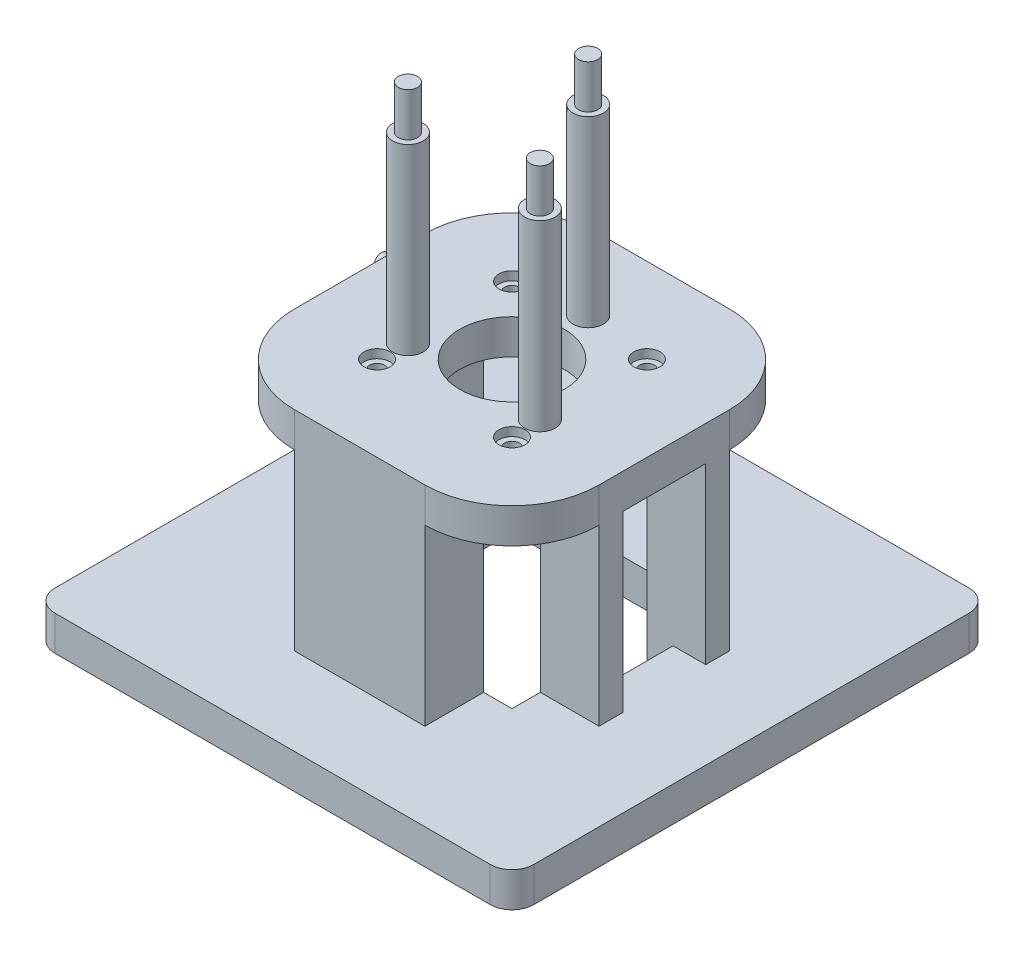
from build123d import *

# Parameters (mm, degrees)
SKETCH_3_W                   = 31
SKETCH_3_H                   = 31
EXTRUDE_2_DEPTH              = 8
SKETCH_10_R                  = 12
CUT_EXTRUDE_1_DEPTH          = 51.139804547
HOLE_WIZARD_M3_1_D           = 3.4
HOLE_WIZARD_M3_1_CBORE_D     = 6
HOLE_WIZARD_M3_1_CBORE_DEPTH = 2
SKETCH_18_W                  = 13.5
SKETCH_18_H                  = 30
EXTRUDE_3_DEPTH              = 40
SKETCH_27_W                  = 30
SKETCH_27_H                  = 13.5
SKETCH_27_W_2                = 13.5
SKETCH_27_H_2                = 5.5
EXTRUDE_6_DEPTH              = 40
SKETCH_29_W                  = 110
SKETCH_29_H                  = 110
EXTRUDE_7_DEPTH              = 8
FILLET_4_R                   = 5
SKETCH_30_W                  = 43
SKETCH_30_H                  = 43
CUT_EXTRUDE_4_DEPTH          = 8
CUT_EXTRUDE_5_REACH          = 93.4
SKETCH_32_W                  = 6
SKETCH_32_H                  = 19
SKETCH_36_R                  = 3.5
EXTRUDE_8_DEPTH              = 42
SKETCH_37_R                  = 2.200228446
EXTRUDE_9_DEPTH              = 10
SKETCH_39_R                  = 1.7
EXTRUDE_10_DEPTH             = 5


with BuildPart() as part:
    # Sketch 3 → Extrude 2 (new body)
    # profile 1 of 3: a face of its own
    with BuildSketch(Plane(origin=(0, 0, 0), x_dir=(1, 0, 0), z_dir=(0, 1, 0))):
        with BuildLine():
            ThreePointArc((15, 35), (29.142135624, 29.142135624), (35, 15))
            Line((35, 15), (35, -15))
            ThreePointArc((35, -15), (29.142135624, -29.142135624), (15, -35))
            Line((15, -35), (-15, -35))
            ThreePointArc((-15, -35), (-29.142135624, -29.142135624), (-35, -15))
            Line((-35, -15), (-35, 15))
            ThreePointArc((-35, 15), (-29.142135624, 29.142135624), (-15, 35))
            Line((-15, 35), (15, 35))
        make_face()
        with BuildLine():
            ThreePointArc((-15, 25), (-22.071067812, 22.071067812), (-25, 15))
            Line((-25, 15), (-25, -15))
            ThreePointArc((-25, -15), (-22.071067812, -22.071067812), (-15, -25))
            Line((-15, -25), (15, -25))
            ThreePointArc((15, -25), (22.071067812, -22.071067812), (25, -15))
            Line((25, -15), (25, 15))
            ThreePointArc((25, 15), (22.071067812, 22.071067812), (15, 25))
            Line((15, 25), (-15, 25))
        make_face(mode=Mode.SUBTRACT)
    # profile 2 of 3: a face of its own
    with BuildSketch(Plane(origin=(0, 0, 0), x_dir=(1, 0, 0), z_dir=(0, 1, 0))):
        with BuildLine():
            Line((-15, 25), (15, 25))
            ThreePointArc((15, 25), (22.071067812, 22.071067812), (25, 15))
            Line((25, 15), (25, -15))
            ThreePointArc((25, -15), (22.071067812, -22.071067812), (15, -25))
            Line((15, -25), (-15, -25))
            ThreePointArc((-15, -25), (-22.071067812, -22.071067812), (-25, -15))
            Line((-25, -15), (-25, 15))
            ThreePointArc((-25, 15), (-22.071067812, 22.071067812), (-15, 25))
        make_face()
        Rectangle(SKETCH_3_W, SKETCH_3_H, mode=Mode.SUBTRACT)
    # profile 3 of 3: a face of its own
    with BuildSketch(Plane(origin=(0, 0, 0), x_dir=(1, 0, 0), z_dir=(0, 1, 0))):
        Rectangle(SKETCH_3_W, SKETCH_3_H)
    extrude(amount=-EXTRUDE_2_DEPTH)

    # Sketch 10 → Cut-Extrude 1 (cut, through all)
    with BuildSketch(Plane(origin=(0, 0, 0), x_dir=(1, 0, 0), z_dir=(0, 1, 0))):
        with Locations(Location((0, 0, 0), (0, 0, 270))):
            Circle(SKETCH_10_R)
    extrude(amount=-CUT_EXTRUDE_1_DEPTH, mode=Mode.SUBTRACT)

    # Hole Wizard M3 _1 (through all)
    with Locations(Plane(origin=(0, 0, 0), x_dir=(1, 0, 0), z_dir=(0, 1, 0))):
        with Locations((-15.5, 15.5), (15.5, 15.5), (15.5, -15.5), (-15.5, -15.5)):
            CounterBoreHole(HOLE_WIZARD_M3_1_D / 2, HOLE_WIZARD_M3_1_CBORE_D / 2, HOLE_WIZARD_M3_1_CBORE_DEPTH)

    # Sketch 18 → Extrude 3 (add)
    with BuildSketch(Plane.XZ.offset(8)):
        with Locations((-28.25, 0)):
            Rectangle(SKETCH_18_W, SKETCH_18_H)
    extrude(amount=EXTRUDE_3_DEPTH)

    # Sketch 27 → Extrude 6 (add)
    with BuildSketch(Plane.XZ.offset(8)):
        with Locations((0, 28.25)):
            Rectangle(SKETCH_27_W, SKETCH_27_H)
        with Locations((28.25, 12.25)):
            Rectangle(SKETCH_27_W_2, SKETCH_27_H_2)
        with Locations((28.25, -12.25)):
            Rectangle(SKETCH_27_W_2, SKETCH_27_H_2)
    extrude(amount=EXTRUDE_6_DEPTH)

    # Sketch 29 → Extrude 7 (add)
    with BuildSketch(Plane.XZ.offset(48)):
        Rectangle(SKETCH_29_W, SKETCH_29_H)
    extrude(amount=EXTRUDE_7_DEPTH)

    # Fillet 4
    fillet_4_edges = [part.edges().sort_by_distance(p)[0] for p in [
        (55, -52, -55),
        (55, -52, 55),
        (-55, -52, 55),
        (-55, -52, -55),
    ]]
    fillet(fillet_4_edges, radius=FILLET_4_R)

    # Sketch 30 → Cut-Extrude 4 (cut)
    with BuildSketch(Plane.XZ.offset(56)):
        Rectangle(SKETCH_30_W, SKETCH_30_H)
    extrude(amount=-CUT_EXTRUDE_4_DEPTH, mode=Mode.SUBTRACT)

    # Sketch 32 → Cut-Extrude 5 (cut, up to next)
    with BuildSketch(Plane(origin=(0, -48, 0), x_dir=(1, 0, 0), z_dir=(0, 1, 0)), mode=Mode.PRIVATE) as cut_extrude_5_sk1:
        with Locations((24.5, 0)):
            Rectangle(SKETCH_32_W, SKETCH_32_H)
    cut_extrude_5_tool1 = extrude(cut_extrude_5_sk1.sketch, amount=-CUT_EXTRUDE_5_REACH, mode=Mode.PRIVATE) & part.part
    add(cut_extrude_5_tool1.solids().sort_by_distance((24.5, -48, 0))[0], mode=Mode.SUBTRACT)

    # Sketch 36 → Extrude 8 (add)
    with BuildSketch(Plane(origin=(0, 0, 0), x_dir=(1, 0, 0), z_dir=(0, 1, 0))):
        with Locations(Location((0, 17.5, 0), (0, 0, 90))):
            Circle(SKETCH_36_R)
        with Locations(Location((15.155444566, -8.75, 0), (0, 0, 90))):
            Circle(SKETCH_36_R)
        with Locations(Location((-15.155444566, -8.75, 0), (0, 0, 90))):
            Circle(SKETCH_36_R)
    extrude(amount=EXTRUDE_8_DEPTH)

    # Sketch 37 → Extrude 9 (add)
    with BuildSketch(Plane(origin=(0, 42, 0), x_dir=(1, 0, 0), z_dir=(0, 1, 0))):
        with Locations(Location((0, 17.5, 0), (0, 0, 270))):
            Circle(SKETCH_37_R)
        with Locations(Location((15.155444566, -8.75, 0), (0, 0, 270))):
            Circle(SKETCH_37_R)
        with Locations(Location((-15.155444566, -8.75, 0), (0, 0, 270))):
            Circle(SKETCH_37_R)
    extrude(amount=EXTRUDE_9_DEPTH)

    # Sketch 39 → Extrude 10 (add)
    with BuildSketch(Plane.ZY.offset(35)):
        with Locations((-10, -5.456897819)):
            Circle(SKETCH_39_R)
        with Locations((-10, -41.456897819)):
            Circle(SKETCH_39_R)
    extrude(amount=EXTRUDE_10_DEPTH)


solid = part.part
